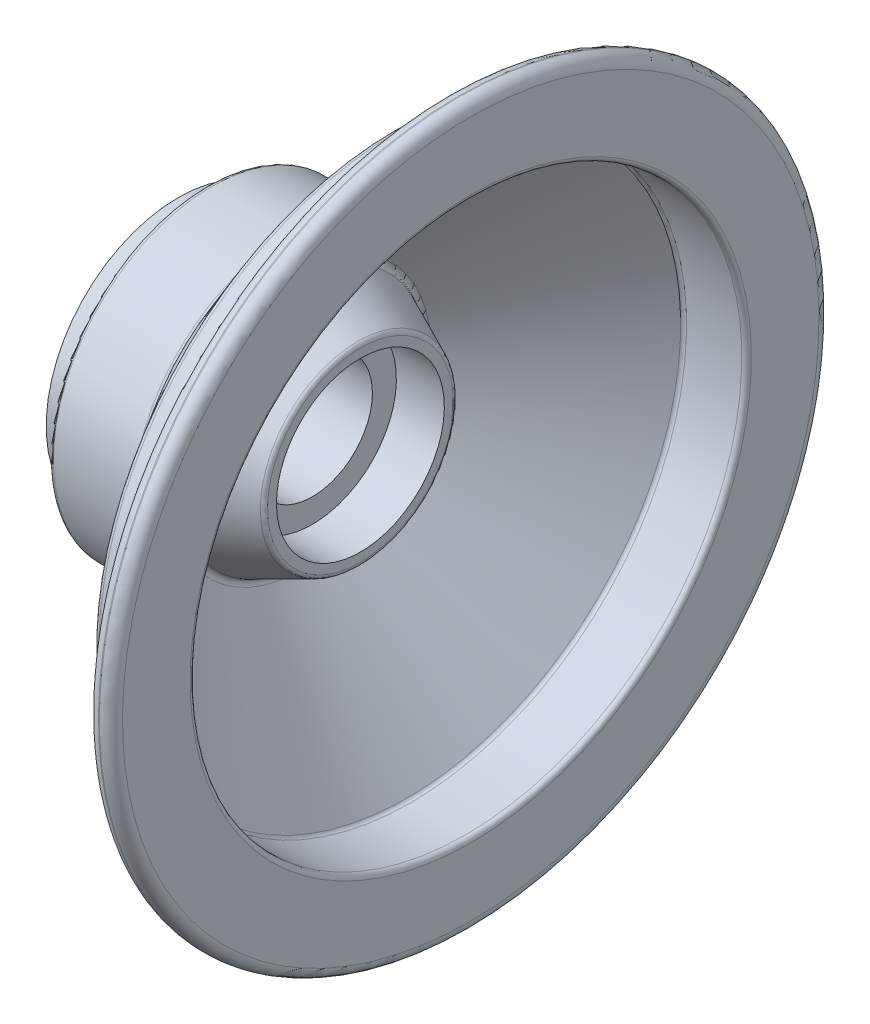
from build123d import *

# Parameters (mm, degrees)
CONG_1_R                = 2.4
CONG_2_R                = 1
ESQUISSE2_R             = 2.5
ENL_V_MAT_EXTRU_1_DEPTH = 18


with BuildPart() as part:
    # Esquisse1 → Base-R_volution (revolve)
    with BuildSketch(Plane.XY, mode=Mode.PRIVATE) as base_r_volution_sk:
        Polygon((-6, -12.5), (-6, -27.5), (0, -27.5), (0, -33), (18, -33), (39.433004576, -62.5), (50, -62.5), (50, -75), (55, -75), (55, -57.5), (41.980631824, -57.5), (19, -25.869873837), (32, -20), (32, -17.5), (22, -17.5), (22, -12.5), align=None)
    revolve(base_r_volution_sk.sketch.rotate(Axis((60.027241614, 0, 0), (-1, 0, 0)), 180), axis=Axis((60.027241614, 0, 0), (-1, 0, 0)))

    # Cong_1
    cong_1_edges = [part.edges().sort_by_distance(p)[0] for p in [
        (50, -75, 0),
        (55, -75, 0),
    ]]
    fillet(cong_1_edges, radius=CONG_1_R)

    # Cong_2
    cong_2_edges = [part.edges().sort_by_distance(p)[0] for p in [
        (50, -62.5, 0),
        (39.433004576, -62.5, 0),
        (18, -33, 0),
        (0, -33, 0),
        (55, -57.5, 0),
        (41.980631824, -57.5, 0),
        (19, -25.869873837, 0),
        (32, -20, 0),
    ]]
    fillet(cong_2_edges, radius=CONG_2_R)

    # Esquisse2 → Enl_v. mat.-Extru.1 (cut)
    with BuildSketch(Plane.ZY.offset(6)):
        with Locations(Location((0, 23, 0), (0, 0, 270))):
            Circle(ESQUISSE2_R)
        with Locations(Location((23, 0, 0), (0, 0, 270))):
            Circle(ESQUISSE2_R)
        with Locations(Location((0, -23, 0), (0, 0, 270))):
            Circle(ESQUISSE2_R)
        with Locations(Location((-23, 0, 0), (0, 0, 270))):
            Circle(ESQUISSE2_R)
    extrude(amount=-ENL_V_MAT_EXTRU_1_DEPTH, mode=Mode.SUBTRACT)


solid = part.part
